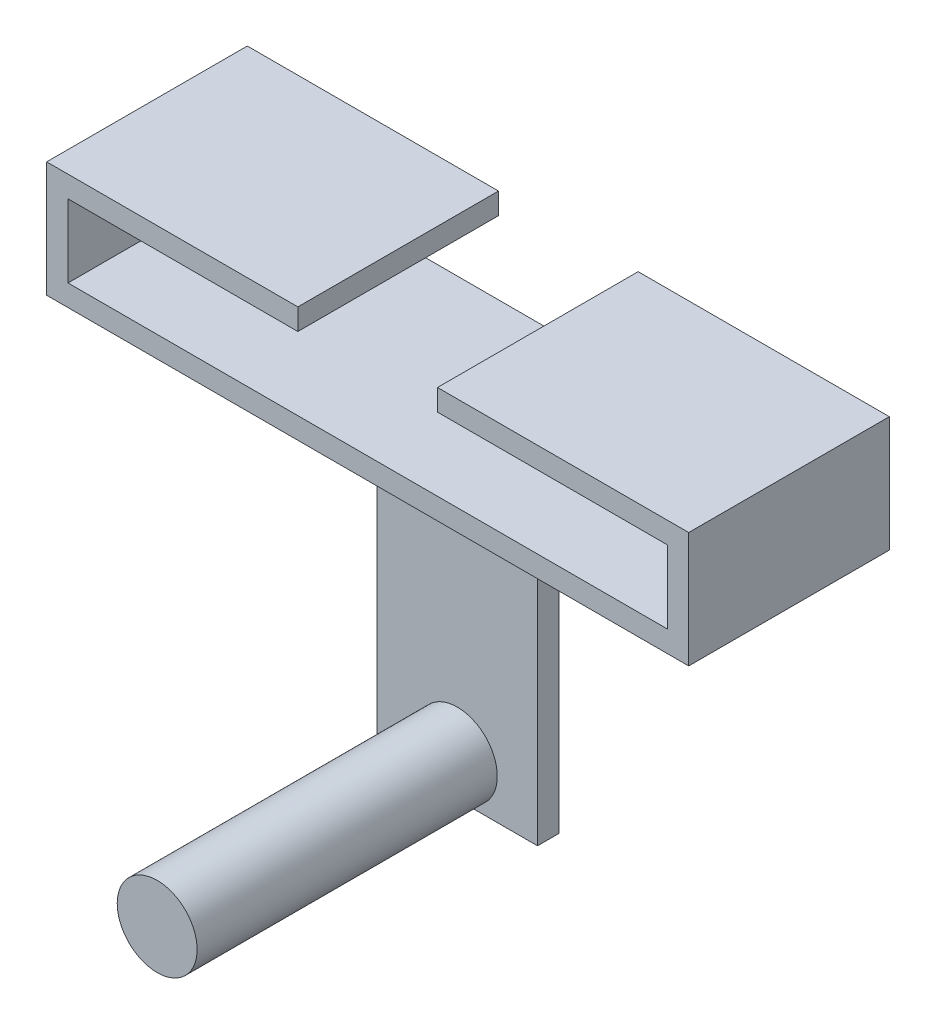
ISO-10303-21;
HEADER;
FILE_DESCRIPTION(('STEP AP214'),'2;1');
FILE_NAME('part.step','',(''),(''),'','','');
FILE_SCHEMA(('AUTOMOTIVE_DESIGN { 1 0 10303 214 1 1 1 1 }'));
ENDSEC;
DATA;
#1=APPLICATION_CONTEXT('core data for automotive mechanical design processes');
#2=APPLICATION_PROTOCOL_DEFINITION('international standard','automotive_design',2000,#1);
#3=PRODUCT_CONTEXT('',#1,'mechanical');
#4=PRODUCT('Part','Part','',(#3));
#5=PRODUCT_RELATED_PRODUCT_CATEGORY('part','',(#4));
#6=PRODUCT_DEFINITION_FORMATION('','',#4);
#7=PRODUCT_DEFINITION_CONTEXT('part definition',#1,'design');
#8=PRODUCT_DEFINITION('design','',#6,#7);
#9=PRODUCT_DEFINITION_SHAPE('','',#8);
#10=(LENGTH_UNIT() NAMED_UNIT(*) SI_UNIT(.MILLI.,.METRE.));
#11=(NAMED_UNIT(*) PLANE_ANGLE_UNIT() SI_UNIT($,.RADIAN.));
#12=(NAMED_UNIT(*) SI_UNIT($,.STERADIAN.) SOLID_ANGLE_UNIT());
#13=UNCERTAINTY_MEASURE_WITH_UNIT(LENGTH_MEASURE(1.E-05),#10,'distance_accuracy_value','');
#14=(GEOMETRIC_REPRESENTATION_CONTEXT(3) GLOBAL_UNCERTAINTY_ASSIGNED_CONTEXT((#13)) GLOBAL_UNIT_ASSIGNED_CONTEXT((#10,
#11,#12)) REPRESENTATION_CONTEXT('',''));
#15=CARTESIAN_POINT('',(0.,0.,0.));
#16=DIRECTION('',(0.,0.,1.));
#17=DIRECTION('',(1.,0.,0.));
#18=AXIS2_PLACEMENT_3D('',#15,#16,#17);
#19=CARTESIAN_POINT('',(63.48984,-50.8,-14.1859));
#20=DIRECTION('',(0.,0.,-1.));
#21=DIRECTION('',(-1.,0.,0.));
#22=AXIS2_PLACEMENT_3D('',#19,#20,#21);
#23=PLANE('',#22);
#24=DIRECTION('',(-1.,0.,0.));
#25=VECTOR('',#24,1.);
#26=CARTESIAN_POINT('',(63.48984,0.,-14.1859));
#27=LINE('',#26,#25);
#28=CARTESIAN_POINT('',(63.48984,0.,-14.1859));
#29=VERTEX_POINT('',#28);
#30=CARTESIAN_POINT('',(38.11016,0.,-14.1859));
#31=VERTEX_POINT('',#30);
#32=EDGE_CURVE('E457',#29,#31,#27,.T.);
#33=ORIENTED_EDGE('',*,*,#32,.T.);
#34=DIRECTION('',(0.,1.,0.));
#35=VECTOR('',#34,1.);
#36=CARTESIAN_POINT('',(38.11016,-50.8,-14.1859));
#37=LINE('',#36,#35);
#38=CARTESIAN_POINT('',(38.11016,-50.8,-14.1859));
#39=VERTEX_POINT('',#38);
#40=EDGE_CURVE('E170',#39,#31,#37,.T.);
#41=ORIENTED_EDGE('',*,*,#40,.F.);
#42=DIRECTION('',(-1.,0.,0.));
#43=VECTOR('',#42,1.);
#44=CARTESIAN_POINT('',(63.48984,-50.8,-14.1859));
#45=LINE('',#44,#43);
#46=CARTESIAN_POINT('',(63.48984,-50.8,-14.1859));
#47=VERTEX_POINT('',#46);
#48=EDGE_CURVE('E163',#47,#39,#45,.T.);
#49=ORIENTED_EDGE('',*,*,#48,.F.);
#50=DIRECTION('',(0.,1.,0.));
#51=VECTOR('',#50,1.);
#52=CARTESIAN_POINT('',(63.48984,-50.8,-14.1859));
#53=LINE('',#52,#51);
#54=EDGE_CURVE('E167',#47,#29,#53,.T.);
#55=ORIENTED_EDGE('',*,*,#54,.T.);
#56=EDGE_LOOP('',(#33,#41,#49,#55));
#57=FACE_BOUND('',#56,.T.);
#58=CARTESIAN_POINT('',(50.8,-44.45,-14.1859));
#59=DIRECTION('',(0.,0.,1.));
#60=DIRECTION('',(1.,0.,0.));
#61=AXIS2_PLACEMENT_3D('',#58,#59,#60);
#62=CIRCLE('',#61,6.3246);
#63=CARTESIAN_POINT('',(44.4754,-44.45,-14.1859));
#64=VERTEX_POINT('',#63);
#65=EDGE_CURVE('E455',#64,#64,#62,.T.);
#66=ORIENTED_EDGE('',*,*,#65,.F.);
#67=EDGE_LOOP('',(#66));
#68=FACE_BOUND('',#67,.T.);
#69=ADVANCED_FACE('F47',(#57,#68),#23,.F.);
#70=CARTESIAN_POINT('',(0.,0.,0.));
#71=DIRECTION('',(0.,-1.,0.));
#72=DIRECTION('',(0.,0.,-1.));
#73=AXIS2_PLACEMENT_3D('',#70,#71,#72);
#74=PLANE('',#73);
#75=DIRECTION('',(0.,0.,-1.));
#76=VECTOR('',#75,1.);
#77=CARTESIAN_POINT('',(0.,0.,0.));
#78=LINE('',#77,#76);
#79=CARTESIAN_POINT('',(0.,0.,0.));
#80=VERTEX_POINT('',#79);
#81=CARTESIAN_POINT('',(0.,0.,-31.75));
#82=VERTEX_POINT('',#81);
#83=EDGE_CURVE('E241',#80,#82,#78,.T.);
#84=ORIENTED_EDGE('',*,*,#83,.T.);
#85=DIRECTION('',(1.,0.,0.));
#86=VECTOR('',#85,1.);
#87=CARTESIAN_POINT('',(0.,0.,-31.75));
#88=LINE('',#87,#86);
#89=CARTESIAN_POINT('',(101.6,0.,-31.75));
#90=VERTEX_POINT('',#89);
#91=EDGE_CURVE('E264',#82,#90,#88,.T.);
#92=ORIENTED_EDGE('',*,*,#91,.T.);
#93=DIRECTION('',(0.,0.,-1.));
#94=VECTOR('',#93,1.);
#95=CARTESIAN_POINT('',(101.6,0.,0.));
#96=LINE('',#95,#94);
#97=CARTESIAN_POINT('',(101.6,0.,0.));
#98=VERTEX_POINT('',#97);
#99=EDGE_CURVE('E267',#98,#90,#96,.T.);
#100=ORIENTED_EDGE('',*,*,#99,.F.);
#101=DIRECTION('',(1.,0.,0.));
#102=VECTOR('',#101,1.);
#103=CARTESIAN_POINT('',(0.,0.,0.));
#104=LINE('',#103,#102);
#105=EDGE_CURVE('E251',#80,#98,#104,.T.);
#106=ORIENTED_EDGE('',*,*,#105,.F.);
#107=EDGE_LOOP('',(#84,#92,#100,#106));
#108=FACE_BOUND('',#107,.T.);
#109=ORIENTED_EDGE('',*,*,#32,.F.);
#110=DIRECTION('',(0.,0.,1.));
#111=VECTOR('',#110,1.);
#112=CARTESIAN_POINT('',(63.48984,0.,-17.5641));
#113=LINE('',#112,#111);
#114=CARTESIAN_POINT('',(63.48984,0.,-17.5641));
#115=VERTEX_POINT('',#114);
#116=EDGE_CURVE('E186',#115,#29,#113,.T.);
#117=ORIENTED_EDGE('',*,*,#116,.F.);
#118=DIRECTION('',(1.,0.,0.));
#119=VECTOR('',#118,1.);
#120=CARTESIAN_POINT('',(63.48984,0.,-17.5641));
#121=LINE('',#120,#119);
#122=CARTESIAN_POINT('',(38.11016,0.,-17.5641));
#123=VERTEX_POINT('',#122);
#124=EDGE_CURVE('E182',#123,#115,#121,.T.);
#125=ORIENTED_EDGE('',*,*,#124,.F.);
#126=DIRECTION('',(0.,0.,-1.));
#127=VECTOR('',#126,1.);
#128=CARTESIAN_POINT('',(38.11016,0.,-17.5641));
#129=LINE('',#128,#127);
#130=EDGE_CURVE('E466',#31,#123,#129,.T.);
#131=ORIENTED_EDGE('',*,*,#130,.F.);
#132=EDGE_LOOP('',(#109,#117,#125,#131));
#133=FACE_BOUND('',#132,.T.);
#134=ADVANCED_FACE('F284',(#108,#133),#74,.T.);
#135=CARTESIAN_POINT('',(0.,18.288,0.));
#136=DIRECTION('',(0.,-1.,0.));
#137=DIRECTION('',(0.,0.,-1.));
#138=AXIS2_PLACEMENT_3D('',#135,#136,#137);
#139=PLANE('',#138);
#140=DIRECTION('',(1.,0.,0.));
#141=VECTOR('',#140,1.);
#142=CARTESIAN_POINT('',(0.,18.288,-31.75));
#143=LINE('',#142,#141);
#144=CARTESIAN_POINT('',(61.849,18.288,-31.75));
#145=VERTEX_POINT('',#144);
#146=CARTESIAN_POINT('',(101.6,18.288,-31.75));
#147=VERTEX_POINT('',#146);
#148=EDGE_CURVE('E250',#145,#147,#143,.T.);
#149=ORIENTED_EDGE('',*,*,#148,.F.);
#150=DIRECTION('',(0.,0.,-1.));
#151=VECTOR('',#150,1.);
#152=CARTESIAN_POINT('',(61.849,18.288,-31.75));
#153=LINE('',#152,#151);
#154=CARTESIAN_POINT('',(61.849,18.288,0.));
#155=VERTEX_POINT('',#154);
#156=EDGE_CURVE('E234',#155,#145,#153,.T.);
#157=ORIENTED_EDGE('',*,*,#156,.F.);
#158=DIRECTION('',(1.,0.,0.));
#159=VECTOR('',#158,1.);
#160=CARTESIAN_POINT('',(0.,18.288,0.));
#161=LINE('',#160,#159);
#162=CARTESIAN_POINT('',(101.6,18.288,0.));
#163=VERTEX_POINT('',#162);
#164=EDGE_CURVE('E258',#155,#163,#161,.T.);
#165=ORIENTED_EDGE('',*,*,#164,.T.);
#166=DIRECTION('',(0.,0.,-1.));
#167=VECTOR('',#166,1.);
#168=CARTESIAN_POINT('',(101.6,18.288,0.));
#169=LINE('',#168,#167);
#170=EDGE_CURVE('E255',#163,#147,#169,.T.);
#171=ORIENTED_EDGE('',*,*,#170,.T.);
#172=EDGE_LOOP('',(#149,#157,#165,#171));
#173=FACE_BOUND('',#172,.T.);
#174=ADVANCED_FACE('F296',(#173),#139,.F.);
#175=CARTESIAN_POINT('',(0.,18.288,0.));
#176=DIRECTION('',(-1.,0.,0.));
#177=DIRECTION('',(0.,0.,1.));
#178=AXIS2_PLACEMENT_3D('',#175,#176,#177);
#179=PLANE('',#178);
#180=ORIENTED_EDGE('',*,*,#83,.F.);
#181=DIRECTION('',(0.,-1.,0.));
#182=VECTOR('',#181,1.);
#183=CARTESIAN_POINT('',(0.,18.288,0.));
#184=LINE('',#183,#182);
#185=CARTESIAN_POINT('',(0.,18.288,0.));
#186=VERTEX_POINT('',#185);
#187=EDGE_CURVE('E11',#186,#80,#184,.T.);
#188=ORIENTED_EDGE('',*,*,#187,.F.);
#189=DIRECTION('',(0.,0.,-1.));
#190=VECTOR('',#189,1.);
#191=CARTESIAN_POINT('',(0.,18.288,0.));
#192=LINE('',#191,#190);
#193=CARTESIAN_POINT('',(0.,18.288,-31.75));
#194=VERTEX_POINT('',#193);
#195=EDGE_CURVE('E247',#186,#194,#192,.T.);
#196=ORIENTED_EDGE('',*,*,#195,.T.);
#197=DIRECTION('',(0.,-1.,0.));
#198=VECTOR('',#197,1.);
#199=CARTESIAN_POINT('',(0.,18.288,-31.75));
#200=LINE('',#199,#198);
#201=EDGE_CURVE('E51',#194,#82,#200,.T.);
#202=ORIENTED_EDGE('',*,*,#201,.T.);
#203=EDGE_LOOP('',(#180,#188,#196,#202));
#204=FACE_BOUND('',#203,.T.);
#205=ADVANCED_FACE('F49',(#204),#179,.T.);
#206=CARTESIAN_POINT('',(0.,18.288,0.));
#207=DIRECTION('',(0.,0.,-1.));
#208=DIRECTION('',(-1.,0.,0.));
#209=AXIS2_PLACEMENT_3D('',#206,#207,#208);
#210=PLANE('',#209);
#211=DIRECTION('',(1.,0.,0.));
#212=VECTOR('',#211,1.);
#213=CARTESIAN_POINT('',(39.751,3.3782,0.));
#214=LINE('',#213,#212);
#215=CARTESIAN_POINT('',(3.3782,3.3782,0.));
#216=VERTEX_POINT('',#215);
#217=CARTESIAN_POINT('',(98.2218,3.3782,0.));
#218=VERTEX_POINT('',#217);
#219=EDGE_CURVE('E233',#216,#218,#214,.T.);
#220=ORIENTED_EDGE('',*,*,#219,.F.);
#221=DIRECTION('',(0.,-1.,0.));
#222=VECTOR('',#221,1.);
#223=CARTESIAN_POINT('',(3.3782,3.3782,0.));
#224=LINE('',#223,#222);
#225=CARTESIAN_POINT('',(3.3782,14.9098,0.));
#226=VERTEX_POINT('',#225);
#227=EDGE_CURVE('E200',#226,#216,#224,.T.);
#228=ORIENTED_EDGE('',*,*,#227,.F.);
#229=DIRECTION('',(-1.,0.,0.));
#230=VECTOR('',#229,1.);
#231=CARTESIAN_POINT('',(39.751,14.9098,0.));
#232=LINE('',#231,#230);
#233=CARTESIAN_POINT('',(39.751,14.9098,0.));
#234=VERTEX_POINT('',#233);
#235=EDGE_CURVE('E204',#234,#226,#232,.T.);
#236=ORIENTED_EDGE('',*,*,#235,.F.);
#237=DIRECTION('',(0.,1.,0.));
#238=VECTOR('',#237,1.);
#239=CARTESIAN_POINT('',(39.751,3.3782,0.));
#240=LINE('',#239,#238);
#241=CARTESIAN_POINT('',(39.751,18.288,0.));
#242=VERTEX_POINT('',#241);
#243=EDGE_CURVE('E244',#234,#242,#240,.T.);
#244=ORIENTED_EDGE('',*,*,#243,.T.);
#245=EDGE_CURVE('E259',#186,#242,#161,.T.);
#246=ORIENTED_EDGE('',*,*,#245,.F.);
#247=ORIENTED_EDGE('',*,*,#187,.T.);
#248=ORIENTED_EDGE('',*,*,#105,.T.);
#249=DIRECTION('',(0.,-1.,0.));
#250=VECTOR('',#249,1.);
#251=CARTESIAN_POINT('',(101.6,18.288,0.));
#252=LINE('',#251,#250);
#253=EDGE_CURVE('E56',#163,#98,#252,.T.);
#254=ORIENTED_EDGE('',*,*,#253,.F.);
#255=ORIENTED_EDGE('',*,*,#164,.F.);
#256=DIRECTION('',(0.,1.,0.));
#257=VECTOR('',#256,1.);
#258=CARTESIAN_POINT('',(61.849,3.3782,0.));
#259=LINE('',#258,#257);
#260=CARTESIAN_POINT('',(61.849,14.9098,0.));
#261=VERTEX_POINT('',#260);
#262=EDGE_CURVE('E242',#261,#155,#259,.T.);
#263=ORIENTED_EDGE('',*,*,#262,.F.);
#264=DIRECTION('',(-1.,0.,0.));
#265=VECTOR('',#264,1.);
#266=CARTESIAN_POINT('',(61.849,14.9098,0.));
#267=LINE('',#266,#265);
#268=CARTESIAN_POINT('',(98.2218,14.9098,0.));
#269=VERTEX_POINT('',#268);
#270=EDGE_CURVE('E222',#269,#261,#267,.T.);
#271=ORIENTED_EDGE('',*,*,#270,.F.);
#272=DIRECTION('',(0.,1.,0.));
#273=VECTOR('',#272,1.);
#274=CARTESIAN_POINT('',(98.2218,3.3782,0.));
#275=LINE('',#274,#273);
#276=EDGE_CURVE('E207',#218,#269,#275,.T.);
#277=ORIENTED_EDGE('',*,*,#276,.F.);
#278=EDGE_LOOP('',(#220,#228,#236,#244,#246,#247,#248,#254,#255,#263,#271,#277));
#279=FACE_BOUND('',#278,.T.);
#280=ADVANCED_FACE('F288',(#279),#210,.F.);
#281=CARTESIAN_POINT('',(101.6,18.288,0.));
#282=DIRECTION('',(-1.,0.,0.));
#283=DIRECTION('',(0.,0.,1.));
#284=AXIS2_PLACEMENT_3D('',#281,#282,#283);
#285=PLANE('',#284);
#286=ORIENTED_EDGE('',*,*,#99,.T.);
#287=DIRECTION('',(0.,-1.,0.));
#288=VECTOR('',#287,1.);
#289=CARTESIAN_POINT('',(101.6,18.288,-31.75));
#290=LINE('',#289,#288);
#291=EDGE_CURVE('E272',#147,#90,#290,.T.);
#292=ORIENTED_EDGE('',*,*,#291,.F.);
#293=ORIENTED_EDGE('',*,*,#170,.F.);
#294=ORIENTED_EDGE('',*,*,#253,.T.);
#295=EDGE_LOOP('',(#286,#292,#293,#294));
#296=FACE_BOUND('',#295,.T.);
#297=ADVANCED_FACE('F293',(#296),#285,.F.);
#298=CARTESIAN_POINT('',(0.,18.288,-31.75));
#299=DIRECTION('',(0.,0.,-1.));
#300=DIRECTION('',(-1.,0.,0.));
#301=AXIS2_PLACEMENT_3D('',#298,#299,#300);
#302=PLANE('',#301);
#303=DIRECTION('',(0.,-1.,0.));
#304=VECTOR('',#303,1.);
#305=CARTESIAN_POINT('',(3.3782,3.3782,-31.75));
#306=LINE('',#305,#304);
#307=CARTESIAN_POINT('',(3.3782,14.9098,-31.75));
#308=VERTEX_POINT('',#307);
#309=CARTESIAN_POINT('',(3.3782,3.3782,-31.75));
#310=VERTEX_POINT('',#309);
#311=EDGE_CURVE('E199',#308,#310,#306,.T.);
#312=ORIENTED_EDGE('',*,*,#311,.T.);
#313=DIRECTION('',(-1.,0.,0.));
#314=VECTOR('',#313,1.);
#315=CARTESIAN_POINT('',(39.751,3.3782,-31.75));
#316=LINE('',#315,#314);
#317=CARTESIAN_POINT('',(98.2218,3.3782,-31.75));
#318=VERTEX_POINT('',#317);
#319=EDGE_CURVE('E231',#318,#310,#316,.T.);
#320=ORIENTED_EDGE('',*,*,#319,.F.);
#321=DIRECTION('',(0.,1.,0.));
#322=VECTOR('',#321,1.);
#323=CARTESIAN_POINT('',(98.2218,3.3782,-31.75));
#324=LINE('',#323,#322);
#325=CARTESIAN_POINT('',(98.2218,14.9098,-31.75));
#326=VERTEX_POINT('',#325);
#327=EDGE_CURVE('E224',#318,#326,#324,.T.);
#328=ORIENTED_EDGE('',*,*,#327,.T.);
#329=DIRECTION('',(-1.,0.,0.));
#330=VECTOR('',#329,1.);
#331=CARTESIAN_POINT('',(61.849,14.9098,-31.75));
#332=LINE('',#331,#330);
#333=CARTESIAN_POINT('',(61.849,14.9098,-31.75));
#334=VERTEX_POINT('',#333);
#335=EDGE_CURVE('E220',#326,#334,#332,.T.);
#336=ORIENTED_EDGE('',*,*,#335,.T.);
#337=DIRECTION('',(0.,1.,0.));
#338=VECTOR('',#337,1.);
#339=CARTESIAN_POINT('',(61.849,3.3782,-31.75));
#340=LINE('',#339,#338);
#341=EDGE_CURVE('E239',#334,#145,#340,.T.);
#342=ORIENTED_EDGE('',*,*,#341,.T.);
#343=ORIENTED_EDGE('',*,*,#148,.T.);
#344=ORIENTED_EDGE('',*,*,#291,.T.);
#345=ORIENTED_EDGE('',*,*,#91,.F.);
#346=ORIENTED_EDGE('',*,*,#201,.F.);
#347=CARTESIAN_POINT('',(39.751,18.288,-31.75));
#348=VERTEX_POINT('',#347);
#349=EDGE_CURVE('E252',#194,#348,#143,.T.);
#350=ORIENTED_EDGE('',*,*,#349,.T.);
#351=DIRECTION('',(0.,1.,0.));
#352=VECTOR('',#351,1.);
#353=CARTESIAN_POINT('',(39.751,3.3782,-31.75));
#354=LINE('',#353,#352);
#355=CARTESIAN_POINT('',(39.751,14.9098,-31.75));
#356=VERTEX_POINT('',#355);
#357=EDGE_CURVE('E72',#356,#348,#354,.T.);
#358=ORIENTED_EDGE('',*,*,#357,.F.);
#359=DIRECTION('',(-1.,0.,0.));
#360=VECTOR('',#359,1.);
#361=CARTESIAN_POINT('',(39.751,14.9098,-31.75));
#362=LINE('',#361,#360);
#363=EDGE_CURVE('E196',#356,#308,#362,.T.);
#364=ORIENTED_EDGE('',*,*,#363,.T.);
#365=EDGE_LOOP('',(#312,#320,#328,#336,#342,#343,#344,#345,#346,#350,#358,#364));
#366=FACE_BOUND('',#365,.T.);
#367=ADVANCED_FACE('F280',(#366),#302,.T.);
#368=ORIENTED_EDGE('',*,*,#245,.T.);
#369=DIRECTION('',(0.,0.,1.));
#370=VECTOR('',#369,1.);
#371=CARTESIAN_POINT('',(39.751,18.288,0.));
#372=LINE('',#371,#370);
#373=EDGE_CURVE('E213',#348,#242,#372,.T.);
#374=ORIENTED_EDGE('',*,*,#373,.F.);
#375=ORIENTED_EDGE('',*,*,#349,.F.);
#376=ORIENTED_EDGE('',*,*,#195,.F.);
#377=EDGE_LOOP('',(#368,#374,#375,#376));
#378=FACE_BOUND('',#377,.T.);
#379=ADVANCED_FACE('F324',(#378),#139,.F.);
#380=CARTESIAN_POINT('',(61.849,3.3782,-31.75));
#381=DIRECTION('',(1.,0.,0.));
#382=DIRECTION('',(0.,0.,-1.));
#383=AXIS2_PLACEMENT_3D('',#380,#381,#382);
#384=PLANE('',#383);
#385=ORIENTED_EDGE('',*,*,#341,.F.);
#386=DIRECTION('',(0.,0.,1.));
#387=VECTOR('',#386,1.);
#388=CARTESIAN_POINT('',(61.849,14.9098,-31.75));
#389=LINE('',#388,#387);
#390=EDGE_CURVE('E188',#334,#261,#389,.T.);
#391=ORIENTED_EDGE('',*,*,#390,.T.);
#392=ORIENTED_EDGE('',*,*,#262,.T.);
#393=ORIENTED_EDGE('',*,*,#156,.T.);
#394=EDGE_LOOP('',(#385,#391,#392,#393));
#395=FACE_BOUND('',#394,.T.);
#396=ADVANCED_FACE('F303',(#395),#384,.F.);
#397=CARTESIAN_POINT('',(39.751,3.3782,0.));
#398=DIRECTION('',(-1.,0.,0.));
#399=DIRECTION('',(0.,0.,1.));
#400=AXIS2_PLACEMENT_3D('',#397,#398,#399);
#401=PLANE('',#400);
#402=ORIENTED_EDGE('',*,*,#243,.F.);
#403=DIRECTION('',(0.,0.,1.));
#404=VECTOR('',#403,1.);
#405=CARTESIAN_POINT('',(39.751,14.9098,-31.75));
#406=LINE('',#405,#404);
#407=EDGE_CURVE('E203',#356,#234,#406,.T.);
#408=ORIENTED_EDGE('',*,*,#407,.F.);
#409=ORIENTED_EDGE('',*,*,#357,.T.);
#410=ORIENTED_EDGE('',*,*,#373,.T.);
#411=EDGE_LOOP('',(#402,#408,#409,#410));
#412=FACE_BOUND('',#411,.T.);
#413=ADVANCED_FACE('F322',(#412),#401,.F.);
#414=CARTESIAN_POINT('',(0.,3.3782,0.));
#415=DIRECTION('',(0.,-1.,0.));
#416=DIRECTION('',(0.,0.,-1.));
#417=AXIS2_PLACEMENT_3D('',#414,#415,#416);
#418=PLANE('',#417);
#419=ORIENTED_EDGE('',*,*,#319,.T.);
#420=DIRECTION('',(0.,0.,1.));
#421=VECTOR('',#420,1.);
#422=CARTESIAN_POINT('',(3.3782,3.3782,-31.75));
#423=LINE('',#422,#421);
#424=EDGE_CURVE('E210',#310,#216,#423,.T.);
#425=ORIENTED_EDGE('',*,*,#424,.T.);
#426=ORIENTED_EDGE('',*,*,#219,.T.);
#427=DIRECTION('',(0.,0.,1.));
#428=VECTOR('',#427,1.);
#429=CARTESIAN_POINT('',(98.2218,3.3782,-31.75));
#430=LINE('',#429,#428);
#431=EDGE_CURVE('E217',#318,#218,#430,.T.);
#432=ORIENTED_EDGE('',*,*,#431,.F.);
#433=EDGE_LOOP('',(#419,#425,#426,#432));
#434=FACE_BOUND('',#433,.T.);
#435=ADVANCED_FACE('F315',(#434),#418,.F.);
#436=CARTESIAN_POINT('',(61.849,14.9098,-31.75));
#437=DIRECTION('',(0.,1.,0.));
#438=DIRECTION('',(-1.,0.,0.));
#439=AXIS2_PLACEMENT_3D('',#436,#437,#438);
#440=PLANE('',#439);
#441=ORIENTED_EDGE('',*,*,#270,.T.);
#442=ORIENTED_EDGE('',*,*,#390,.F.);
#443=ORIENTED_EDGE('',*,*,#335,.F.);
#444=DIRECTION('',(0.,0.,1.));
#445=VECTOR('',#444,1.);
#446=CARTESIAN_POINT('',(98.2218,14.9098,-31.75));
#447=LINE('',#446,#445);
#448=EDGE_CURVE('E191',#326,#269,#447,.T.);
#449=ORIENTED_EDGE('',*,*,#448,.T.);
#450=EDGE_LOOP('',(#441,#442,#443,#449));
#451=FACE_BOUND('',#450,.T.);
#452=ADVANCED_FACE('F306',(#451),#440,.F.);
#453=CARTESIAN_POINT('',(98.2218,3.3782,-31.75));
#454=DIRECTION('',(1.,0.,0.));
#455=DIRECTION('',(0.,0.,-1.));
#456=AXIS2_PLACEMENT_3D('',#453,#454,#455);
#457=PLANE('',#456);
#458=ORIENTED_EDGE('',*,*,#276,.T.);
#459=ORIENTED_EDGE('',*,*,#448,.F.);
#460=ORIENTED_EDGE('',*,*,#327,.F.);
#461=ORIENTED_EDGE('',*,*,#431,.T.);
#462=EDGE_LOOP('',(#458,#459,#460,#461));
#463=FACE_BOUND('',#462,.T.);
#464=ADVANCED_FACE('F310',(#463),#457,.F.);
#465=CARTESIAN_POINT('',(3.3782,3.3782,-31.75));
#466=DIRECTION('',(-1.,0.,0.));
#467=DIRECTION('',(0.,0.,1.));
#468=AXIS2_PLACEMENT_3D('',#465,#466,#467);
#469=PLANE('',#468);
#470=ORIENTED_EDGE('',*,*,#227,.T.);
#471=ORIENTED_EDGE('',*,*,#424,.F.);
#472=ORIENTED_EDGE('',*,*,#311,.F.);
#473=DIRECTION('',(0.,0.,1.));
#474=VECTOR('',#473,1.);
#475=CARTESIAN_POINT('',(3.3782,14.9098,-31.75));
#476=LINE('',#475,#474);
#477=EDGE_CURVE('E214',#308,#226,#476,.T.);
#478=ORIENTED_EDGE('',*,*,#477,.T.);
#479=EDGE_LOOP('',(#470,#471,#472,#478));
#480=FACE_BOUND('',#479,.T.);
#481=ADVANCED_FACE('F318',(#480),#469,.F.);
#482=CARTESIAN_POINT('',(39.751,14.9098,-31.75));
#483=DIRECTION('',(0.,1.,0.));
#484=DIRECTION('',(-1.,0.,0.));
#485=AXIS2_PLACEMENT_3D('',#482,#483,#484);
#486=PLANE('',#485);
#487=ORIENTED_EDGE('',*,*,#235,.T.);
#488=ORIENTED_EDGE('',*,*,#477,.F.);
#489=ORIENTED_EDGE('',*,*,#363,.F.);
#490=ORIENTED_EDGE('',*,*,#407,.T.);
#491=EDGE_LOOP('',(#487,#488,#489,#490));
#492=FACE_BOUND('',#491,.T.);
#493=ADVANCED_FACE('F320',(#492),#486,.F.);
#494=CARTESIAN_POINT('',(63.48984,-50.8,-17.5641));
#495=DIRECTION('',(-1.,0.,0.));
#496=DIRECTION('',(0.,0.,1.));
#497=AXIS2_PLACEMENT_3D('',#494,#495,#496);
#498=PLANE('',#497);
#499=ORIENTED_EDGE('',*,*,#116,.T.);
#500=ORIENTED_EDGE('',*,*,#54,.F.);
#501=DIRECTION('',(0.,0.,1.));
#502=VECTOR('',#501,1.);
#503=CARTESIAN_POINT('',(63.48984,-50.8,-17.5641));
#504=LINE('',#503,#502);
#505=CARTESIAN_POINT('',(63.48984,-50.8,-17.5641));
#506=VERTEX_POINT('',#505);
#507=EDGE_CURVE('E174',#506,#47,#504,.T.);
#508=ORIENTED_EDGE('',*,*,#507,.F.);
#509=DIRECTION('',(0.,1.,0.));
#510=VECTOR('',#509,1.);
#511=CARTESIAN_POINT('',(63.48984,-50.8,-17.5641));
#512=LINE('',#511,#510);
#513=EDGE_CURVE('E463',#506,#115,#512,.T.);
#514=ORIENTED_EDGE('',*,*,#513,.T.);
#515=EDGE_LOOP('',(#499,#500,#508,#514));
#516=FACE_BOUND('',#515,.T.);
#517=ADVANCED_FACE('F184',(#516),#498,.F.);
#518=CARTESIAN_POINT('',(38.11016,-50.8,-17.5641));
#519=DIRECTION('',(1.,0.,0.));
#520=DIRECTION('',(0.,0.,-1.));
#521=AXIS2_PLACEMENT_3D('',#518,#519,#520);
#522=PLANE('',#521);
#523=ORIENTED_EDGE('',*,*,#130,.T.);
#524=DIRECTION('',(0.,1.,0.));
#525=VECTOR('',#524,1.);
#526=CARTESIAN_POINT('',(38.11016,-50.8,-17.5641));
#527=LINE('',#526,#525);
#528=CARTESIAN_POINT('',(38.11016,-50.8,-17.5641));
#529=VERTEX_POINT('',#528);
#530=EDGE_CURVE('E64',#529,#123,#527,.T.);
#531=ORIENTED_EDGE('',*,*,#530,.F.);
#532=DIRECTION('',(0.,0.,-1.));
#533=VECTOR('',#532,1.);
#534=CARTESIAN_POINT('',(38.11016,-50.8,-17.5641));
#535=LINE('',#534,#533);
#536=EDGE_CURVE('E173',#39,#529,#535,.T.);
#537=ORIENTED_EDGE('',*,*,#536,.F.);
#538=ORIENTED_EDGE('',*,*,#40,.T.);
#539=EDGE_LOOP('',(#523,#531,#537,#538));
#540=FACE_BOUND('',#539,.T.);
#541=ADVANCED_FACE('F345',(#540),#522,.F.);
#542=CARTESIAN_POINT('',(63.48984,-50.8,-17.5641));
#543=DIRECTION('',(0.,0.,1.));
#544=DIRECTION('',(1.,0.,0.));
#545=AXIS2_PLACEMENT_3D('',#542,#543,#544);
#546=PLANE('',#545);
#547=ORIENTED_EDGE('',*,*,#124,.T.);
#548=ORIENTED_EDGE('',*,*,#513,.F.);
#549=DIRECTION('',(1.,0.,0.));
#550=VECTOR('',#549,1.);
#551=CARTESIAN_POINT('',(63.48984,-50.8,-17.5641));
#552=LINE('',#551,#550);
#553=EDGE_CURVE('E178',#529,#506,#552,.T.);
#554=ORIENTED_EDGE('',*,*,#553,.F.);
#555=ORIENTED_EDGE('',*,*,#530,.T.);
#556=EDGE_LOOP('',(#547,#548,#554,#555));
#557=FACE_BOUND('',#556,.T.);
#558=ADVANCED_FACE('F405',(#557),#546,.F.);
#559=CARTESIAN_POINT('',(0.,-50.8,0.));
#560=DIRECTION('',(0.,-1.,0.));
#561=DIRECTION('',(0.,0.,-1.));
#562=AXIS2_PLACEMENT_3D('',#559,#560,#561);
#563=PLANE('',#562);
#564=ORIENTED_EDGE('',*,*,#507,.T.);
#565=ORIENTED_EDGE('',*,*,#48,.T.);
#566=ORIENTED_EDGE('',*,*,#536,.T.);
#567=ORIENTED_EDGE('',*,*,#553,.T.);
#568=EDGE_LOOP('',(#564,#565,#566,#567));
#569=FACE_BOUND('',#568,.T.);
#570=ADVANCED_FACE('F177',(#569),#563,.T.);
#571=CARTESIAN_POINT('',(50.8,-44.45,33.3121));
#572=DIRECTION('',(0.,0.,-1.));
#573=DIRECTION('',(-1.,0.,0.));
#574=AXIS2_PLACEMENT_3D('',#571,#572,#573);
#575=CYLINDRICAL_SURFACE('',#574,6.3246);
#576=CARTESIAN_POINT('',(50.8,-44.45,33.3121));
#577=DIRECTION('',(0.,0.,1.));
#578=DIRECTION('',(1.,0.,0.));
#579=AXIS2_PLACEMENT_3D('',#576,#577,#578);
#580=CIRCLE('',#579,6.3246);
#581=CARTESIAN_POINT('',(44.4754,-44.45,33.3121));
#582=VERTEX_POINT('',#581);
#583=EDGE_CURVE('E453',#582,#582,#580,.T.);
#584=CARTESIAN_POINT('',(44.4754,-44.45,-14.1859));
#585=CARTESIAN_POINT('',(44.4754,-44.45,-13.6911291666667));
#586=CARTESIAN_POINT('',(44.4754,-44.45,-13.1963583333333));
#587=CARTESIAN_POINT('',(44.4754,-44.45,-12.2068166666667));
#588=CARTESIAN_POINT('',(44.4754,-44.45,-11.7120458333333));
#589=CARTESIAN_POINT('',(44.4754,-44.45,-10.7225041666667));
#590=CARTESIAN_POINT('',(44.4754,-44.45,-10.2277333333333));
#591=CARTESIAN_POINT('',(44.4754,-44.45,-9.23819166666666));
#592=CARTESIAN_POINT('',(44.4754,-44.45,-8.74342083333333));
#593=CARTESIAN_POINT('',(44.4754,-44.45,-7.75387916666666));
#594=CARTESIAN_POINT('',(44.4754,-44.45,-7.25910833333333));
#595=CARTESIAN_POINT('',(44.4754,-44.45,-6.26956666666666));
#596=CARTESIAN_POINT('',(44.4754,-44.45,-5.77479583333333));
#597=CARTESIAN_POINT('',(44.4754,-44.45,-4.78525416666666));
#598=CARTESIAN_POINT('',(44.4754,-44.45,-4.29048333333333));
#599=CARTESIAN_POINT('',(44.4754,-44.45,-3.30094166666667));
#600=CARTESIAN_POINT('',(44.4754,-44.45,-2.80617083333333));
#601=CARTESIAN_POINT('',(44.4754,-44.45,-1.81662916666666));
#602=CARTESIAN_POINT('',(44.4754,-44.45,-1.32185833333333));
#603=CARTESIAN_POINT('',(44.4754,-44.45,-0.332316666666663));
#604=CARTESIAN_POINT('',(44.4754,-44.45,0.162454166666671));
#605=CARTESIAN_POINT('',(44.4754,-44.45,1.15199583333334));
#606=CARTESIAN_POINT('',(44.4754,-44.45,1.64676666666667));
#607=CARTESIAN_POINT('',(44.4754,-44.45,2.63630833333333));
#608=CARTESIAN_POINT('',(44.4754,-44.45,3.13107916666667));
#609=CARTESIAN_POINT('',(44.4754,-44.45,4.12062083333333));
#610=CARTESIAN_POINT('',(44.4754,-44.45,4.61539166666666));
#611=CARTESIAN_POINT('',(44.4754,-44.45,5.60493333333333));
#612=CARTESIAN_POINT('',(44.4754,-44.45,6.09970416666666));
#613=CARTESIAN_POINT('',(44.4754,-44.45,7.08924583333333));
#614=CARTESIAN_POINT('',(44.4754,-44.45,7.58401666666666));
#615=CARTESIAN_POINT('',(44.4754,-44.45,8.57355833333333));
#616=CARTESIAN_POINT('',(44.4754,-44.45,9.06832916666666));
#617=CARTESIAN_POINT('',(44.4754,-44.45,10.0578708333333));
#618=CARTESIAN_POINT('',(44.4754,-44.45,10.5526416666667));
#619=CARTESIAN_POINT('',(44.4754,-44.45,11.5421833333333));
#620=CARTESIAN_POINT('',(44.4754,-44.45,12.0369541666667));
#621=CARTESIAN_POINT('',(44.4754,-44.45,13.0264958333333));
#622=CARTESIAN_POINT('',(44.4754,-44.45,13.5212666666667));
#623=CARTESIAN_POINT('',(44.4754,-44.45,14.5108083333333));
#624=CARTESIAN_POINT('',(44.4754,-44.45,15.0055791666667));
#625=CARTESIAN_POINT('',(44.4754,-44.45,15.9951208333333));
#626=CARTESIAN_POINT('',(44.4754,-44.45,16.4898916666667));
#627=CARTESIAN_POINT('',(44.4754,-44.45,17.4794333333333));
#628=CARTESIAN_POINT('',(44.4754,-44.45,17.9742041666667));
#629=CARTESIAN_POINT('',(44.4754,-44.45,18.9637458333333));
#630=CARTESIAN_POINT('',(44.4754,-44.45,19.4585166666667));
#631=CARTESIAN_POINT('',(44.4754,-44.45,20.4480583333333));
#632=CARTESIAN_POINT('',(44.4754,-44.45,20.9428291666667));
#633=CARTESIAN_POINT('',(44.4754,-44.45,21.9323708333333));
#634=CARTESIAN_POINT('',(44.4754,-44.45,22.4271416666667));
#635=CARTESIAN_POINT('',(44.4754,-44.45,23.4166833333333));
#636=CARTESIAN_POINT('',(44.4754,-44.45,23.9114541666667));
#637=CARTESIAN_POINT('',(44.4754,-44.45,24.9009958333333));
#638=CARTESIAN_POINT('',(44.4754,-44.45,25.3957666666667));
#639=CARTESIAN_POINT('',(44.4754,-44.45,26.3853083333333));
#640=CARTESIAN_POINT('',(44.4754,-44.45,26.8800791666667));
#641=CARTESIAN_POINT('',(44.4754,-44.45,27.8696208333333));
#642=CARTESIAN_POINT('',(44.4754,-44.45,28.3643916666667));
#643=CARTESIAN_POINT('',(44.4754,-44.45,29.3539333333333));
#644=CARTESIAN_POINT('',(44.4754,-44.45,29.8487041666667));
#645=CARTESIAN_POINT('',(44.4754,-44.45,30.8382458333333));
#646=CARTESIAN_POINT('',(44.4754,-44.45,31.3330166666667));
#647=CARTESIAN_POINT('',(44.4754,-44.45,32.3225583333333));
#648=CARTESIAN_POINT('',(44.4754,-44.45,32.8173291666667));
#649=CARTESIAN_POINT('',(44.4754,-44.45,33.3121));
#650=B_SPLINE_CURVE_WITH_KNOTS('',3,(#584,#585,#586,#587,#588,#589,#590,#591,#592,#593,#594,
#595,#596,#597,#598,#599,#600,#601,#602,#603,#604,#605,#606,#607,#608,#609,#610,#611,#612,#613,
#614,#615,#616,#617,#618,#619,#620,#621,#622,#623,#624,#625,#626,#627,#628,#629,#630,#631,#632,
#633,#634,#635,#636,#637,#638,#639,#640,#641,#642,#643,#644,#645,#646,#647,#648,#649),
.UNSPECIFIED.,.F.,.F.,(4,2,2,2,2,2,2,2,2,2,2,2,2,2,2,2,2,2,2,2,2,2,2,2,2,2,2,2,2,2,2,2,4),(0.,
1.4843125,2.968625,4.4529375,5.93725,7.4215625,8.905875,10.3901875,11.8745,13.3588125,14.843125,
16.3274375,17.81175,19.2960625,20.780375,22.2646875,23.749,25.2333125,26.717625,28.2019375,
29.68625,31.1705625,32.654875,34.1391875,35.6235,37.1078125,38.592125,40.0764375,41.56075,
43.0450625,44.529375,46.0136875,47.498),.UNSPECIFIED.);
#651=EDGE_CURVE('BSEAM417',#64,#582,#650,.T.);
#652=ORIENTED_EDGE('',*,*,#65,.T.);
#653=ORIENTED_EDGE('',*,*,#583,.F.);
#654=ORIENTED_EDGE('',*,*,#651,.T.);
#655=ORIENTED_EDGE('',*,*,#651,.F.);
#656=EDGE_LOOP('',(#652,#654,#653,#655));
#657=FACE_BOUND('',#656,.T.);
#658=ADVANCED_FACE('F417',(#657),#575,.T.);
#659=CARTESIAN_POINT('',(0.,0.,33.3121));
#660=DIRECTION('',(0.,0.,1.));
#661=DIRECTION('',(1.,0.,0.));
#662=AXIS2_PLACEMENT_3D('',#659,#660,#661);
#663=PLANE('',#662);
#664=ORIENTED_EDGE('',*,*,#583,.T.);
#665=EDGE_LOOP('',(#664));
#666=FACE_BOUND('',#665,.T.);
#667=ADVANCED_FACE('F429',(#666),#663,.T.);
#668=CLOSED_SHELL('',(#69,#134,#174,#205,#280,#297,#367,#379,#396,#413,#435,#452,#464,#481,#493,
#517,#541,#558,#570,#658,#667));
#669=MANIFOLD_SOLID_BREP('B2',#668);
#670=ADVANCED_BREP_SHAPE_REPRESENTATION('',(#18,#669),#14);
#671=SHAPE_DEFINITION_REPRESENTATION(#9,#670);
ENDSEC;
END-ISO-10303-21;
